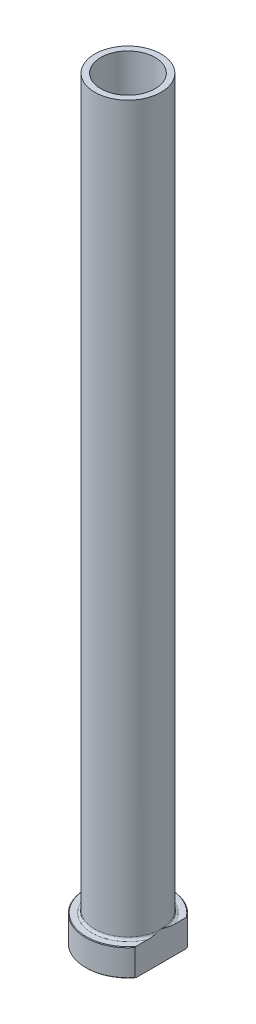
from build123d import *

# Parameters (mm, degrees)
FILLET1_R          = 0.8
CHAMFER1_SIZE      = 0.2
CUT_EXTRUDE1_DEPTH = 251.782774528
CHAMFER2_SIZE      = 0.5


with BuildPart() as part:
    # Sketch1 → Revolve1 (revolve)
    with BuildSketch(Plane.XY, mode=Mode.PRIVATE) as revolve1_sk:
        Polygon((-9, 250), (-11, 250), (-11, 9), (-14, 9), (-14, 0), (-9.25, 0), (-9.25, 183), (-9, 195), align=None)
    revolve(revolve1_sk.sketch.rotate(Axis((0, 92.187680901, 0), (0, -1, 0)), 270), axis=Axis((0, 92.187680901, 0), (0, -1, 0)))

    # Fillet1
    fillet1_edges = [part.edges().sort_by_distance(p)[0] for p in [
        (0, 9, -11),
    ]]
    fillet(fillet1_edges, radius=FILLET1_R)

    # Chamfer1
    chamfer1_edges = [part.edges().sort_by_distance(p)[0] for p in [
        (0, 0, -14),
        (0, 9, -14),
    ]]
    chamfer(chamfer1_edges, length=CHAMFER1_SIZE)

    # Sketch2 → Cut-Extrude1 (cut, through all)
    with BuildSketch(Plane.XZ):
        with BuildLine():
            Line((11, 8.660254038), (11, -8.660254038))
            ThreePointArc((11, -8.660254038), (14, 0), (11, 8.660254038))
        make_face()
    extrude(amount=-CUT_EXTRUDE1_DEPTH, mode=Mode.SUBTRACT)

    # Chamfer2
    chamfer2_edges = [part.edges().sort_by_distance(p)[0] for p in [
        (0, 0, -9.25),
    ]]
    chamfer(chamfer2_edges, length=CHAMFER2_SIZE)


solid = part.part
